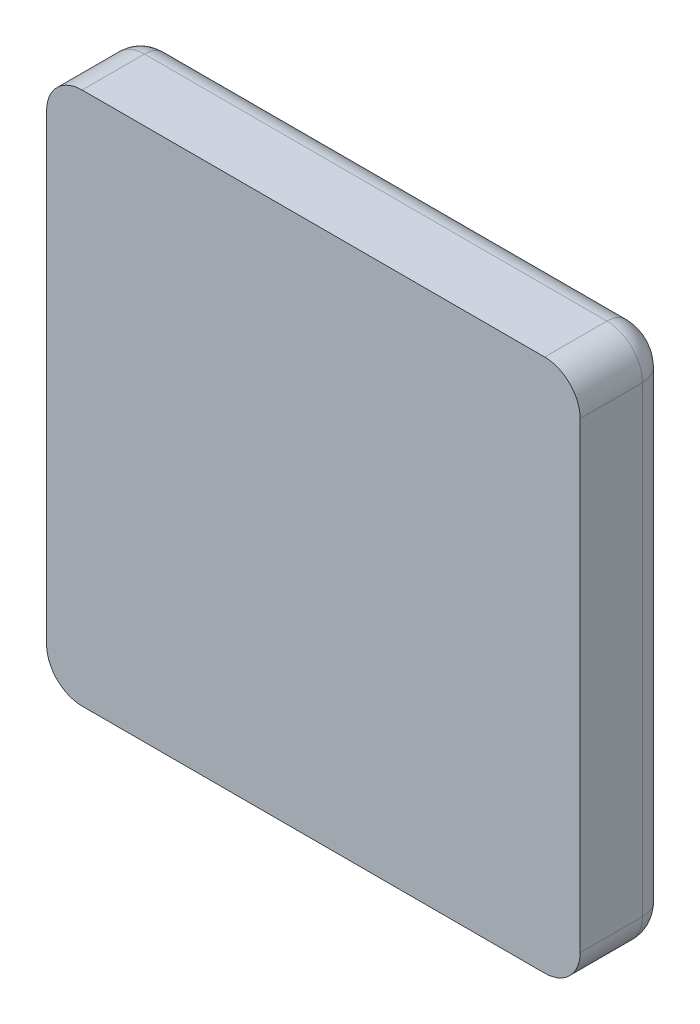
ISO-10303-21;
HEADER;
FILE_DESCRIPTION(('STEP AP214'),'2;1');
FILE_NAME('part.step','',(''),(''),'','','');
FILE_SCHEMA(('AUTOMOTIVE_DESIGN { 1 0 10303 214 1 1 1 1 }'));
ENDSEC;
DATA;
#1=APPLICATION_CONTEXT('core data for automotive mechanical design processes');
#2=APPLICATION_PROTOCOL_DEFINITION('international standard','automotive_design',2000,#1);
#3=PRODUCT_CONTEXT('',#1,'mechanical');
#4=PRODUCT('Part','Part','',(#3));
#5=PRODUCT_RELATED_PRODUCT_CATEGORY('part','',(#4));
#6=PRODUCT_DEFINITION_FORMATION('','',#4);
#7=PRODUCT_DEFINITION_CONTEXT('part definition',#1,'design');
#8=PRODUCT_DEFINITION('design','',#6,#7);
#9=PRODUCT_DEFINITION_SHAPE('','',#8);
#10=(LENGTH_UNIT() NAMED_UNIT(*) SI_UNIT(.MILLI.,.METRE.));
#11=(NAMED_UNIT(*) PLANE_ANGLE_UNIT() SI_UNIT($,.RADIAN.));
#12=(NAMED_UNIT(*) SI_UNIT($,.STERADIAN.) SOLID_ANGLE_UNIT());
#13=UNCERTAINTY_MEASURE_WITH_UNIT(LENGTH_MEASURE(1.E-05),#10,'distance_accuracy_value','');
#14=(GEOMETRIC_REPRESENTATION_CONTEXT(3) GLOBAL_UNCERTAINTY_ASSIGNED_CONTEXT((#13)) GLOBAL_UNIT_ASSIGNED_CONTEXT((#10,
#11,#12)) REPRESENTATION_CONTEXT('',''));
#15=CARTESIAN_POINT('',(0.,0.,0.));
#16=DIRECTION('',(0.,0.,1.));
#17=DIRECTION('',(1.,0.,0.));
#18=AXIS2_PLACEMENT_3D('',#15,#16,#17);
#19=CARTESIAN_POINT('',(0.,0.,-5.));
#20=DIRECTION('',(0.,0.,1.));
#21=DIRECTION('',(1.,0.,0.));
#22=AXIS2_PLACEMENT_3D('',#19,#20,#21);
#23=PLANE('',#22);
#24=DIRECTION('',(-1.,-6.29085455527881E-09,0.));
#25=VECTOR('',#24,1.);
#26=CARTESIAN_POINT('',(8.49265364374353E-08,-13.4999999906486,-5.));
#27=LINE('',#26,#25);
#28=CARTESIAN_POINT('',(-13.0000003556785,-13.5000000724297,-5.));
#29=VERTEX_POINT('',#28);
#30=CARTESIAN_POINT('',(13.000000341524,-13.4999999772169,-5.));
#31=VERTEX_POINT('',#30);
#32=EDGE_CURVE('E123',#29,#31,#27,.F.);
#33=ORIENTED_EDGE('',*,*,#32,.F.);
#34=CARTESIAN_POINT('',(-13.0000003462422,-13.0000003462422,-5.));
#35=DIRECTION('',(0.,0.,1.));
#36=DIRECTION('',(-1.,0.,0.));
#37=AXIS2_PLACEMENT_3D('',#34,#35,#36);
#38=CIRCLE('',#37,0.499999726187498);
#39=CARTESIAN_POINT('',(-13.5000000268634,-13.0000003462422,-5.));
#40=VERTEX_POINT('',#39);
#41=EDGE_CURVE('E116',#40,#29,#38,.T.);
#42=ORIENTED_EDGE('',*,*,#41,.F.);
#43=DIRECTION('',(0.,1.,0.));
#44=VECTOR('',#43,1.);
#45=CARTESIAN_POINT('',(-13.4999999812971,0.,-5.));
#46=LINE('',#45,#44);
#47=CARTESIAN_POINT('',(-13.4999999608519,13.0000003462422,-5.));
#48=VERTEX_POINT('',#47);
#49=EDGE_CURVE('E120',#48,#40,#46,.F.);
#50=ORIENTED_EDGE('',*,*,#49,.F.);
#51=CARTESIAN_POINT('',(-13.0000003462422,13.0000003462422,-5.));
#52=DIRECTION('',(0.,0.,1.));
#53=DIRECTION('',(0.,1.,0.));
#54=AXIS2_PLACEMENT_3D('',#51,#52,#53);
#55=CIRCLE('',#54,0.499999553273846);
#56=CARTESIAN_POINT('',(-13.0000003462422,13.4999998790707,-5.));
#57=VERTEX_POINT('',#56);
#58=EDGE_CURVE('E137',#57,#48,#55,.T.);
#59=ORIENTED_EDGE('',*,*,#58,.F.);
#60=DIRECTION('',(1.,0.,0.));
#61=VECTOR('',#60,1.);
#62=CARTESIAN_POINT('',(0.,13.4999998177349,-5.));
#63=LINE('',#62,#61);
#64=CARTESIAN_POINT('',(13.0000003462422,13.499999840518,-5.));
#65=VERTEX_POINT('',#64);
#66=EDGE_CURVE('E167',#65,#57,#63,.F.);
#67=ORIENTED_EDGE('',*,*,#66,.F.);
#68=CARTESIAN_POINT('',(13.0000003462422,13.0000003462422,-5.));
#69=DIRECTION('',(0.,0.,1.));
#70=DIRECTION('',(1.,0.,0.));
#71=AXIS2_PLACEMENT_3D('',#68,#69,#70);
#72=CIRCLE('',#71,0.499999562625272);
#73=CARTESIAN_POINT('',(13.4999999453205,13.0000003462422,-5.));
#74=VERTEX_POINT('',#73);
#75=EDGE_CURVE('E149',#74,#65,#72,.T.);
#76=ORIENTED_EDGE('',*,*,#75,.F.);
#77=DIRECTION('',(0.,1.,0.));
#78=VECTOR('',#77,1.);
#79=CARTESIAN_POINT('',(13.5,0.,-5.));
#80=LINE('',#79,#78);
#81=CARTESIAN_POINT('',(13.5,-13.0000003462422,-5.));
#82=VERTEX_POINT('',#81);
#83=EDGE_CURVE('E268',#82,#74,#80,.T.);
#84=ORIENTED_EDGE('',*,*,#83,.F.);
#85=CARTESIAN_POINT('',(13.0000003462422,-13.0000003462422,-5.));
#86=DIRECTION('',(0.,0.,1.));
#87=DIRECTION('',(0.,-1.,0.));
#88=AXIS2_PLACEMENT_3D('',#85,#86,#87);
#89=CIRCLE('',#88,0.499999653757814);
#90=EDGE_CURVE('E232',#31,#82,#89,.T.);
#91=ORIENTED_EDGE('',*,*,#90,.F.);
#92=EDGE_LOOP('',(#33,#42,#50,#59,#67,#76,#84,#91));
#93=FACE_BOUND('',#92,.T.);
#94=ADVANCED_FACE('F17',(#93),#23,.F.);
#95=CARTESIAN_POINT('',(-12.5000006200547,-13.0000003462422,-3.5));
#96=DIRECTION('',(0.,1.,0.));
#97=DIRECTION('',(1.,0.,0.));
#98=AXIS2_PLACEMENT_3D('',#95,#96,#97);
#99=CIRCLE('',#98,1.5);
#100=TRIMMED_CURVE('',#99,(PARAMETER_VALUE(-1.91063304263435)),
(PARAMETER_VALUE(1.91063304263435)),.T.,.PARAMETER.);
#101=CARTESIAN_POINT('',(-13.0000003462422,-13.0000003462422,-3.5));
#102=DIRECTION('',(0.,0.,1.));
#103=AXIS1_PLACEMENT('',#101,#102);
#104=SURFACE_OF_REVOLUTION('',#100,#103);
#105=CARTESIAN_POINT('',(-13.0000003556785,-13.5000001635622,-3.5));
#106=DIRECTION('',(-1.,-6.29085455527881E-09,0.));
#107=DIRECTION('',(6.29085455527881E-09,-1.,0.));
#108=AXIS2_PLACEMENT_3D('',#105,#106,#107);
#109=CIRCLE('',#108,1.5);
#110=CARTESIAN_POINT('',(-13.0000003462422,-15.0000001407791,-3.5));
#111=VERTEX_POINT('',#110);
#112=EDGE_CURVE('E126',#111,#29,#109,.F.);
#113=ORIENTED_EDGE('',*,*,#112,.F.);
#114=CARTESIAN_POINT('',(-13.0000003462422,-13.0000003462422,-3.5));
#115=DIRECTION('',(0.,0.,1.));
#116=DIRECTION('',(1.,0.,0.));
#117=AXIS2_PLACEMENT_3D('',#114,#115,#116);
#118=CIRCLE('',#117,1.9999997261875);
#119=CARTESIAN_POINT('',(-15.0000000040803,-13.0000003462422,-3.5));
#120=VERTEX_POINT('',#119);
#121=EDGE_CURVE('E69',#120,#111,#118,.T.);
#122=ORIENTED_EDGE('',*,*,#121,.F.);
#123=CARTESIAN_POINT('',(-13.4999999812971,-13.0000003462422,-3.5));
#124=DIRECTION('',(0.,1.,0.));
#125=DIRECTION('',(-1.,0.,0.));
#126=AXIS2_PLACEMENT_3D('',#123,#124,#125);
#127=CIRCLE('',#126,1.5);
#128=EDGE_CURVE('E129',#40,#120,#127,.T.);
#129=ORIENTED_EDGE('',*,*,#128,.F.);
#130=ORIENTED_EDGE('',*,*,#41,.T.);
#131=EDGE_LOOP('',(#113,#122,#129,#130));
#132=FACE_BOUND('',#131,.T.);
#133=ADVANCED_FACE('F130',(#132),#104,.F.);
#134=CARTESIAN_POINT('',(8.49265370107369E-08,-13.5000000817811,-3.5));
#135=DIRECTION('',(-1.,-6.29085455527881E-09,0.));
#136=DIRECTION('',(6.29085455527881E-09,-1.,0.));
#137=AXIS2_PLACEMENT_3D('',#134,#135,#136);
#138=CYLINDRICAL_SURFACE('',#137,1.5);
#139=CARTESIAN_POINT('',(13.0000003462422,-13.5,-3.5));
#140=DIRECTION('',(1.,0.,0.));
#141=DIRECTION('',(0.,-1.,0.));
#142=AXIS2_PLACEMENT_3D('',#139,#140,#141);
#143=CIRCLE('',#142,1.5);
#144=CARTESIAN_POINT('',(13.0000003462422,-15.,-3.5));
#145=VERTEX_POINT('',#144);
#146=EDGE_CURVE('E253',#145,#31,#143,.T.);
#147=ORIENTED_EDGE('',*,*,#146,.F.);
#148=DIRECTION('',(1.,6.29085455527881E-09,0.));
#149=VECTOR('',#148,1.);
#150=CARTESIAN_POINT('',(9.43628188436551E-08,-15.0000000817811,-3.5));
#151=LINE('',#150,#149);
#152=EDGE_CURVE('E257',#111,#145,#151,.T.);
#153=ORIENTED_EDGE('',*,*,#152,.F.);
#154=ORIENTED_EDGE('',*,*,#112,.T.);
#155=ORIENTED_EDGE('',*,*,#32,.T.);
#156=EDGE_LOOP('',(#147,#153,#154,#155));
#157=FACE_BOUND('',#156,.T.);
#158=ADVANCED_FACE('F247',(#157),#138,.T.);
#159=CARTESIAN_POINT('',(13.5,-13.0000003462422,-3.5));
#160=DIRECTION('',(0.,1.,0.));
#161=DIRECTION('',(1.,0.,0.));
#162=AXIS2_PLACEMENT_3D('',#159,#160,#161);
#163=CIRCLE('',#162,1.5);
#164=TRIMMED_CURVE('',#163,(PARAMETER_VALUE(-1.91063299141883)),
(PARAMETER_VALUE(1.91063299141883)),.T.,.PARAMETER.);
#165=CARTESIAN_POINT('',(13.0000003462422,-13.0000003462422,-3.5));
#166=DIRECTION('',(0.,0.,1.));
#167=AXIS1_PLACEMENT('',#165,#166);
#168=SURFACE_OF_REVOLUTION('',#164,#167);
#169=ORIENTED_EDGE('',*,*,#146,.T.);
#170=ORIENTED_EDGE('',*,*,#90,.T.);
#171=CARTESIAN_POINT('',(13.5,-13.0000003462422,-3.5));
#172=DIRECTION('',(0.,-1.,0.));
#173=DIRECTION('',(0.,0.,-1.));
#174=AXIS2_PLACEMENT_3D('',#171,#172,#173);
#175=CIRCLE('',#174,1.5);
#176=CARTESIAN_POINT('',(15.,-13.0000003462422,-3.5));
#177=VERTEX_POINT('',#176);
#178=EDGE_CURVE('E270',#177,#82,#175,.F.);
#179=ORIENTED_EDGE('',*,*,#178,.F.);
#180=CARTESIAN_POINT('',(13.0000003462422,-13.0000003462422,-3.5));
#181=DIRECTION('',(0.,0.,1.));
#182=DIRECTION('',(1.,0.,0.));
#183=AXIS2_PLACEMENT_3D('',#180,#181,#182);
#184=CIRCLE('',#183,1.99999965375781);
#185=EDGE_CURVE('E274',#145,#177,#184,.T.);
#186=ORIENTED_EDGE('',*,*,#185,.F.);
#187=EDGE_LOOP('',(#169,#170,#179,#186));
#188=FACE_BOUND('',#187,.T.);
#189=ADVANCED_FACE('F237',(#188),#168,.F.);
#190=CARTESIAN_POINT('',(13.5,0.,-3.5));
#191=DIRECTION('',(0.,-1.,0.));
#192=DIRECTION('',(0.,0.,-1.));
#193=AXIS2_PLACEMENT_3D('',#190,#191,#192);
#194=CYLINDRICAL_SURFACE('',#193,1.5);
#195=ORIENTED_EDGE('',*,*,#178,.T.);
#196=ORIENTED_EDGE('',*,*,#83,.T.);
#197=CARTESIAN_POINT('',(13.4999999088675,13.0000003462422,-3.5));
#198=DIRECTION('',(0.,1.,0.));
#199=DIRECTION('',(1.,0.,0.));
#200=AXIS2_PLACEMENT_3D('',#197,#198,#199);
#201=CIRCLE('',#200,1.5);
#202=CARTESIAN_POINT('',(14.9999999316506,13.0000003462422,-3.5));
#203=VERTEX_POINT('',#202);
#204=EDGE_CURVE('E205',#203,#74,#201,.T.);
#205=ORIENTED_EDGE('',*,*,#204,.F.);
#206=DIRECTION('',(0.,1.,0.));
#207=VECTOR('',#206,1.);
#208=CARTESIAN_POINT('',(15.,0.,-3.5));
#209=LINE('',#208,#207);
#210=EDGE_CURVE('E325',#177,#203,#209,.T.);
#211=ORIENTED_EDGE('',*,*,#210,.F.);
#212=EDGE_LOOP('',(#195,#196,#205,#211));
#213=FACE_BOUND('',#212,.T.);
#214=ADVANCED_FACE('F214',(#213),#194,.T.);
#215=CARTESIAN_POINT('',(13.4999999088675,13.0000003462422,-3.5));
#216=DIRECTION('',(0.,1.,0.));
#217=DIRECTION('',(1.,0.,0.));
#218=AXIS2_PLACEMENT_3D('',#215,#216,#217);
#219=CIRCLE('',#218,1.5);
#220=TRIMMED_CURVE('',#219,(PARAMETER_VALUE(-1.9106329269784)),
(PARAMETER_VALUE(1.9106329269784)),.T.,.PARAMETER.);
#221=CARTESIAN_POINT('',(13.0000003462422,13.0000003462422,-3.5));
#222=DIRECTION('',(0.,0.,1.));
#223=AXIS1_PLACEMENT('',#221,#222);
#224=SURFACE_OF_REVOLUTION('',#220,#223);
#225=ORIENTED_EDGE('',*,*,#204,.T.);
#226=ORIENTED_EDGE('',*,*,#75,.T.);
#227=CARTESIAN_POINT('',(13.0000003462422,13.4999998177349,-3.5));
#228=DIRECTION('',(1.,0.,0.));
#229=DIRECTION('',(0.,1.,0.));
#230=AXIS2_PLACEMENT_3D('',#227,#228,#229);
#231=CIRCLE('',#230,1.5);
#232=CARTESIAN_POINT('',(13.0000003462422,14.999999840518,-3.5));
#233=VERTEX_POINT('',#232);
#234=EDGE_CURVE('E180',#233,#65,#231,.F.);
#235=ORIENTED_EDGE('',*,*,#234,.F.);
#236=CARTESIAN_POINT('',(13.0000003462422,13.0000003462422,-3.5));
#237=DIRECTION('',(0.,0.,1.));
#238=DIRECTION('',(1.,0.,0.));
#239=AXIS2_PLACEMENT_3D('',#236,#237,#238);
#240=CIRCLE('',#239,1.99999956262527);
#241=EDGE_CURVE('E197',#203,#233,#240,.T.);
#242=ORIENTED_EDGE('',*,*,#241,.F.);
#243=EDGE_LOOP('',(#225,#226,#235,#242));
#244=FACE_BOUND('',#243,.T.);
#245=ADVANCED_FACE('F208',(#244),#224,.F.);
#246=CARTESIAN_POINT('',(0.,13.4999998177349,-3.5));
#247=DIRECTION('',(1.,0.,0.));
#248=DIRECTION('',(0.,1.,0.));
#249=AXIS2_PLACEMENT_3D('',#246,#247,#248);
#250=CYLINDRICAL_SURFACE('',#249,1.5);
#251=CARTESIAN_POINT('',(-13.0000003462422,13.499999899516,-3.5));
#252=DIRECTION('',(-1.,0.,0.));
#253=DIRECTION('',(0.,1.,0.));
#254=AXIS2_PLACEMENT_3D('',#251,#252,#253);
#255=CIRCLE('',#254,1.5);
#256=CARTESIAN_POINT('',(-13.0000003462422,14.9999998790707,-3.5));
#257=VERTEX_POINT('',#256);
#258=EDGE_CURVE('E171',#257,#57,#255,.T.);
#259=ORIENTED_EDGE('',*,*,#258,.F.);
#260=DIRECTION('',(-1.,0.,0.));
#261=VECTOR('',#260,1.);
#262=CARTESIAN_POINT('',(0.,14.9999998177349,-3.5));
#263=LINE('',#262,#261);
#264=EDGE_CURVE('E188',#233,#257,#263,.T.);
#265=ORIENTED_EDGE('',*,*,#264,.F.);
#266=ORIENTED_EDGE('',*,*,#234,.T.);
#267=ORIENTED_EDGE('',*,*,#66,.T.);
#268=EDGE_LOOP('',(#259,#265,#266,#267));
#269=FACE_BOUND('',#268,.T.);
#270=ADVANCED_FACE('F213',(#269),#250,.T.);
#271=CARTESIAN_POINT('',(-12.5000007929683,13.0000003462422,-3.5));
#272=DIRECTION('',(0.,1.,0.));
#273=DIRECTION('',(1.,0.,0.));
#274=AXIS2_PLACEMENT_3D('',#271,#272,#273);
#275=CIRCLE('',#274,1.5);
#276=TRIMMED_CURVE('',#275,(PARAMETER_VALUE(-1.91063292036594)),
(PARAMETER_VALUE(1.91063292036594)),.T.,.PARAMETER.);
#277=CARTESIAN_POINT('',(-13.0000003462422,13.0000003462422,-3.5));
#278=DIRECTION('',(0.,0.,1.));
#279=AXIS1_PLACEMENT('',#277,#278);
#280=SURFACE_OF_REVOLUTION('',#276,#279);
#281=CARTESIAN_POINT('',(-13.4999999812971,13.0000003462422,-3.5));
#282=DIRECTION('',(0.,1.,0.));
#283=DIRECTION('',(-1.,0.,0.));
#284=AXIS2_PLACEMENT_3D('',#281,#282,#283);
#285=CIRCLE('',#284,1.5);
#286=CARTESIAN_POINT('',(-14.9999999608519,13.0000003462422,-3.5));
#287=VERTEX_POINT('',#286);
#288=EDGE_CURVE('E135',#287,#48,#285,.F.);
#289=ORIENTED_EDGE('',*,*,#288,.F.);
#290=CARTESIAN_POINT('',(-13.0000003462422,13.0000003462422,-3.5));
#291=DIRECTION('',(0.,0.,1.));
#292=DIRECTION('',(1.,0.,0.));
#293=AXIS2_PLACEMENT_3D('',#290,#291,#292);
#294=CIRCLE('',#293,1.99999955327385);
#295=EDGE_CURVE('E174',#257,#287,#294,.T.);
#296=ORIENTED_EDGE('',*,*,#295,.F.);
#297=ORIENTED_EDGE('',*,*,#258,.T.);
#298=ORIENTED_EDGE('',*,*,#58,.T.);
#299=EDGE_LOOP('',(#289,#296,#297,#298));
#300=FACE_BOUND('',#299,.T.);
#301=ADVANCED_FACE('F173',(#300),#280,.F.);
#302=CARTESIAN_POINT('',(-13.4999999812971,0.,-3.5));
#303=DIRECTION('',(0.,1.,0.));
#304=DIRECTION('',(-1.,0.,0.));
#305=AXIS2_PLACEMENT_3D('',#302,#303,#304);
#306=CYLINDRICAL_SURFACE('',#305,1.5);
#307=ORIENTED_EDGE('',*,*,#128,.T.);
#308=DIRECTION('',(0.,-1.,0.));
#309=VECTOR('',#308,1.);
#310=CARTESIAN_POINT('',(-14.9999999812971,0.,-3.5));
#311=LINE('',#310,#309);
#312=EDGE_CURVE('E300',#287,#120,#311,.T.);
#313=ORIENTED_EDGE('',*,*,#312,.F.);
#314=ORIENTED_EDGE('',*,*,#288,.T.);
#315=ORIENTED_EDGE('',*,*,#49,.T.);
#316=EDGE_LOOP('',(#307,#313,#314,#315));
#317=FACE_BOUND('',#316,.T.);
#318=ADVANCED_FACE('F134',(#317),#306,.T.);
#319=CARTESIAN_POINT('',(-13.0000003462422,-13.0000003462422,-5.));
#320=DIRECTION('',(0.,0.,1.));
#321=DIRECTION('',(1.,0.,0.));
#322=AXIS2_PLACEMENT_3D('',#319,#320,#321);
#323=CYLINDRICAL_SURFACE('',#322,1.9999997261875);
#324=DIRECTION('',(0.,0.,1.));
#325=VECTOR('',#324,1.);
#326=CARTESIAN_POINT('',(-13.0000003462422,-15.0000001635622,-5.));
#327=LINE('',#326,#325);
#328=CARTESIAN_POINT('',(-13.0000003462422,-15.0000001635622,0.));
#329=VERTEX_POINT('',#328);
#330=EDGE_CURVE('E261',#329,#111,#327,.F.);
#331=ORIENTED_EDGE('',*,*,#330,.F.);
#332=CARTESIAN_POINT('',(-13.0000003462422,-13.0000003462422,0.));
#333=DIRECTION('',(0.,0.,1.));
#334=DIRECTION('',(1.,0.,0.));
#335=AXIS2_PLACEMENT_3D('',#332,#333,#334);
#336=CIRCLE('',#335,1.9999997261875);
#337=CARTESIAN_POINT('',(-14.9999999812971,-13.0000003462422,0.));
#338=VERTEX_POINT('',#337);
#339=EDGE_CURVE('E60',#338,#329,#336,.T.);
#340=ORIENTED_EDGE('',*,*,#339,.F.);
#341=DIRECTION('',(0.,0.,1.));
#342=VECTOR('',#341,1.);
#343=CARTESIAN_POINT('',(-14.9999999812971,-13.0000003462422,-5.));
#344=LINE('',#343,#342);
#345=EDGE_CURVE('E303',#120,#338,#344,.T.);
#346=ORIENTED_EDGE('',*,*,#345,.F.);
#347=ORIENTED_EDGE('',*,*,#121,.T.);
#348=EDGE_LOOP('',(#331,#340,#346,#347));
#349=FACE_BOUND('',#348,.T.);
#350=ADVANCED_FACE('F395',(#349),#323,.T.);
#351=CARTESIAN_POINT('',(9.43628188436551E-08,-15.0000000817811,-5.));
#352=DIRECTION('',(6.29085455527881E-09,-1.,0.));
#353=DIRECTION('',(1.,6.29085455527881E-09,0.));
#354=AXIS2_PLACEMENT_3D('',#351,#352,#353);
#355=PLANE('',#354);
#356=DIRECTION('',(0.,0.,1.));
#357=VECTOR('',#356,1.);
#358=CARTESIAN_POINT('',(13.0000003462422,-15.,-5.));
#359=LINE('',#358,#357);
#360=CARTESIAN_POINT('',(13.0000003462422,-15.0000000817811,0.));
#361=VERTEX_POINT('',#360);
#362=EDGE_CURVE('E260',#361,#145,#359,.F.);
#363=ORIENTED_EDGE('',*,*,#362,.F.);
#364=DIRECTION('',(1.,0.,0.));
#365=VECTOR('',#364,1.);
#366=CARTESIAN_POINT('',(0.,-15.0000001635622,0.));
#367=LINE('',#366,#365);
#368=EDGE_CURVE('E342',#329,#361,#367,.T.);
#369=ORIENTED_EDGE('',*,*,#368,.F.);
#370=ORIENTED_EDGE('',*,*,#330,.T.);
#371=ORIENTED_EDGE('',*,*,#152,.T.);
#372=EDGE_LOOP('',(#363,#369,#370,#371));
#373=FACE_BOUND('',#372,.T.);
#374=ADVANCED_FACE('F392',(#373),#355,.T.);
#375=CARTESIAN_POINT('',(13.0000003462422,-13.0000003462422,-5.));
#376=DIRECTION('',(0.,0.,1.));
#377=DIRECTION('',(1.,0.,0.));
#378=AXIS2_PLACEMENT_3D('',#375,#376,#377);
#379=CYLINDRICAL_SURFACE('',#378,1.99999965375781);
#380=DIRECTION('',(0.,0.,-1.));
#381=VECTOR('',#380,1.);
#382=CARTESIAN_POINT('',(15.,-13.0000003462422,-5.));
#383=LINE('',#382,#381);
#384=CARTESIAN_POINT('',(15.,-13.0000003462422,0.));
#385=VERTEX_POINT('',#384);
#386=EDGE_CURVE('E278',#385,#177,#383,.T.);
#387=ORIENTED_EDGE('',*,*,#386,.F.);
#388=CARTESIAN_POINT('',(13.0000003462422,-13.0000003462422,0.));
#389=DIRECTION('',(0.,0.,1.));
#390=DIRECTION('',(1.,0.,0.));
#391=AXIS2_PLACEMENT_3D('',#388,#389,#390);
#392=CIRCLE('',#391,1.99999965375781);
#393=EDGE_CURVE('E282',#361,#385,#392,.T.);
#394=ORIENTED_EDGE('',*,*,#393,.F.);
#395=ORIENTED_EDGE('',*,*,#362,.T.);
#396=ORIENTED_EDGE('',*,*,#185,.T.);
#397=EDGE_LOOP('',(#387,#394,#395,#396));
#398=FACE_BOUND('',#397,.T.);
#399=ADVANCED_FACE('F280',(#398),#379,.T.);
#400=CARTESIAN_POINT('',(15.,0.,-5.));
#401=DIRECTION('',(1.,0.,0.));
#402=DIRECTION('',(0.,0.,-1.));
#403=AXIS2_PLACEMENT_3D('',#400,#401,#402);
#404=PLANE('',#403);
#405=DIRECTION('',(0.,0.,1.));
#406=VECTOR('',#405,1.);
#407=CARTESIAN_POINT('',(14.9999999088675,13.0000003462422,-5.));
#408=LINE('',#407,#406);
#409=CARTESIAN_POINT('',(14.9999999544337,13.0000003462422,0.));
#410=VERTEX_POINT('',#409);
#411=EDGE_CURVE('E200',#410,#203,#408,.F.);
#412=ORIENTED_EDGE('',*,*,#411,.F.);
#413=DIRECTION('',(0.,1.,0.));
#414=VECTOR('',#413,1.);
#415=CARTESIAN_POINT('',(15.,0.,0.));
#416=LINE('',#415,#414);
#417=EDGE_CURVE('E344',#385,#410,#416,.T.);
#418=ORIENTED_EDGE('',*,*,#417,.F.);
#419=ORIENTED_EDGE('',*,*,#386,.T.);
#420=ORIENTED_EDGE('',*,*,#210,.T.);
#421=EDGE_LOOP('',(#412,#418,#419,#420));
#422=FACE_BOUND('',#421,.T.);
#423=ADVANCED_FACE('F386',(#422),#404,.T.);
#424=CARTESIAN_POINT('',(13.0000003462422,13.0000003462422,-5.));
#425=DIRECTION('',(0.,0.,1.));
#426=DIRECTION('',(1.,0.,0.));
#427=AXIS2_PLACEMENT_3D('',#424,#425,#426);
#428=CYLINDRICAL_SURFACE('',#427,1.99999956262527);
#429=DIRECTION('',(0.,0.,1.));
#430=VECTOR('',#429,1.);
#431=CARTESIAN_POINT('',(13.0000003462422,14.9999998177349,-5.));
#432=LINE('',#431,#430);
#433=CARTESIAN_POINT('',(13.0000003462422,14.9999998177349,0.));
#434=VERTEX_POINT('',#433);
#435=EDGE_CURVE('E191',#434,#233,#432,.F.);
#436=ORIENTED_EDGE('',*,*,#435,.F.);
#437=CARTESIAN_POINT('',(13.0000003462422,13.0000003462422,0.));
#438=DIRECTION('',(0.,0.,1.));
#439=DIRECTION('',(1.,0.,0.));
#440=AXIS2_PLACEMENT_3D('',#437,#438,#439);
#441=CIRCLE('',#440,1.99999956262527);
#442=EDGE_CURVE('E345',#410,#434,#441,.T.);
#443=ORIENTED_EDGE('',*,*,#442,.F.);
#444=ORIENTED_EDGE('',*,*,#411,.T.);
#445=ORIENTED_EDGE('',*,*,#241,.T.);
#446=EDGE_LOOP('',(#436,#443,#444,#445));
#447=FACE_BOUND('',#446,.T.);
#448=ADVANCED_FACE('F382',(#447),#428,.T.);
#449=CARTESIAN_POINT('',(0.,14.9999998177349,-5.));
#450=DIRECTION('',(0.,1.,0.));
#451=DIRECTION('',(-1.,0.,0.));
#452=AXIS2_PLACEMENT_3D('',#449,#450,#451);
#453=PLANE('',#452);
#454=DIRECTION('',(0.,0.,1.));
#455=VECTOR('',#454,1.);
#456=CARTESIAN_POINT('',(-13.0000003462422,14.999999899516,-5.));
#457=LINE('',#456,#455);
#458=CARTESIAN_POINT('',(-13.0000003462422,14.9999998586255,0.));
#459=VERTEX_POINT('',#458);
#460=EDGE_CURVE('E190',#459,#257,#457,.F.);
#461=ORIENTED_EDGE('',*,*,#460,.F.);
#462=DIRECTION('',(1.,0.,0.));
#463=VECTOR('',#462,1.);
#464=CARTESIAN_POINT('',(0.,14.9999998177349,0.));
#465=LINE('',#464,#463);
#466=EDGE_CURVE('E348',#434,#459,#465,.F.);
#467=ORIENTED_EDGE('',*,*,#466,.F.);
#468=ORIENTED_EDGE('',*,*,#435,.T.);
#469=ORIENTED_EDGE('',*,*,#264,.T.);
#470=EDGE_LOOP('',(#461,#467,#468,#469));
#471=FACE_BOUND('',#470,.T.);
#472=ADVANCED_FACE('F379',(#471),#453,.T.);
#473=CARTESIAN_POINT('',(-13.0000003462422,13.0000003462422,-5.));
#474=DIRECTION('',(0.,0.,1.));
#475=DIRECTION('',(1.,0.,0.));
#476=AXIS2_PLACEMENT_3D('',#473,#474,#475);
#477=CYLINDRICAL_SURFACE('',#476,1.99999955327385);
#478=DIRECTION('',(0.,0.,1.));
#479=VECTOR('',#478,1.);
#480=CARTESIAN_POINT('',(-14.9999999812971,13.0000003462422,-5.));
#481=LINE('',#480,#479);
#482=CARTESIAN_POINT('',(-14.9999999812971,13.0000003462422,0.));
#483=VERTEX_POINT('',#482);
#484=EDGE_CURVE('E36',#483,#287,#481,.F.);
#485=ORIENTED_EDGE('',*,*,#484,.F.);
#486=CARTESIAN_POINT('',(-13.0000003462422,13.0000003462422,0.));
#487=DIRECTION('',(0.,0.,1.));
#488=DIRECTION('',(1.,0.,0.));
#489=AXIS2_PLACEMENT_3D('',#486,#487,#488);
#490=CIRCLE('',#489,1.99999955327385);
#491=EDGE_CURVE('E27',#459,#483,#490,.T.);
#492=ORIENTED_EDGE('',*,*,#491,.F.);
#493=ORIENTED_EDGE('',*,*,#460,.T.);
#494=ORIENTED_EDGE('',*,*,#295,.T.);
#495=EDGE_LOOP('',(#485,#492,#493,#494));
#496=FACE_BOUND('',#495,.T.);
#497=ADVANCED_FACE('F373',(#496),#477,.T.);
#498=CARTESIAN_POINT('',(-14.9999999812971,0.,-5.));
#499=DIRECTION('',(-1.,0.,0.));
#500=DIRECTION('',(0.,-1.,0.));
#501=AXIS2_PLACEMENT_3D('',#498,#499,#500);
#502=PLANE('',#501);
#503=ORIENTED_EDGE('',*,*,#345,.T.);
#504=DIRECTION('',(0.,1.,0.));
#505=VECTOR('',#504,1.);
#506=CARTESIAN_POINT('',(-14.9999999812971,0.,0.));
#507=LINE('',#506,#505);
#508=EDGE_CURVE('E11',#483,#338,#507,.F.);
#509=ORIENTED_EDGE('',*,*,#508,.F.);
#510=ORIENTED_EDGE('',*,*,#484,.T.);
#511=ORIENTED_EDGE('',*,*,#312,.T.);
#512=EDGE_LOOP('',(#503,#509,#510,#511));
#513=FACE_BOUND('',#512,.T.);
#514=ADVANCED_FACE('F367',(#513),#502,.T.);
#515=CARTESIAN_POINT('',(0.,0.,0.));
#516=DIRECTION('',(0.,0.,1.));
#517=DIRECTION('',(1.,0.,0.));
#518=AXIS2_PLACEMENT_3D('',#515,#516,#517);
#519=PLANE('',#518);
#520=ORIENTED_EDGE('',*,*,#491,.T.);
#521=ORIENTED_EDGE('',*,*,#508,.T.);
#522=ORIENTED_EDGE('',*,*,#339,.T.);
#523=ORIENTED_EDGE('',*,*,#368,.T.);
#524=ORIENTED_EDGE('',*,*,#393,.T.);
#525=ORIENTED_EDGE('',*,*,#417,.T.);
#526=ORIENTED_EDGE('',*,*,#442,.T.);
#527=ORIENTED_EDGE('',*,*,#466,.T.);
#528=EDGE_LOOP('',(#520,#521,#522,#523,#524,#525,#526,#527));
#529=FACE_BOUND('',#528,.T.);
#530=ADVANCED_FACE('F365',(#529),#519,.T.);
#531=CLOSED_SHELL('',(#94,#133,#158,#189,#214,#245,#270,#301,#318,#350,#374,#399,#423,#448,#472,
#497,#514,#530));
#532=MANIFOLD_SOLID_BREP('B1',#531);
#533=ADVANCED_BREP_SHAPE_REPRESENTATION('',(#18,#532),#14);
#534=SHAPE_DEFINITION_REPRESENTATION(#9,#533);
ENDSEC;
END-ISO-10303-21;
